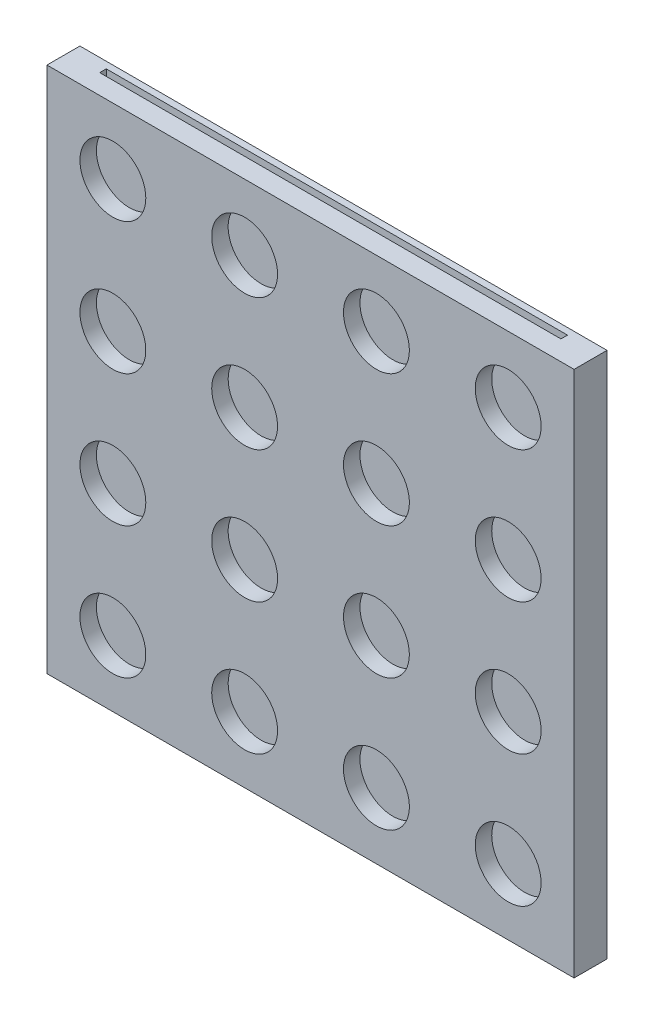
from build123d import *

# Parameters (mm, degrees)
SKETCH1_W           = 101.6
SKETCH1_H           = 101.6
BOSS_EXTRUDE1_DEPTH = 6.35
SKETCH3_R           = 6.35
CUT_EXTRUDE2_DEPTH  = 3.175
SKETCH4_W           = 88.9
SKETCH4_H           = 88.9
CUT_EXTRUDE3_DEPTH  = 2.54
CUT_EXTRUDE4_REACH  = 145.824
SKETCH5_W           = 88.9
SKETCH5_H           = 1.27


with BuildPart() as part:
    # Sketch1 → Boss-Extrude1 (new body)
    with BuildSketch(Plane.XY):
        with Locations((50.8, 50.8)):
            Rectangle(SKETCH1_W, SKETCH1_H)
    extrude(amount=BOSS_EXTRUDE1_DEPTH)

    # Sketch3 → Cut-Extrude2 (cut)
    with BuildSketch(Plane.XY.offset(6.35)):
        with Locations((12.7, 139.7)):
            Circle(SKETCH3_R)
        with Locations((38.1, 139.7)):
            Circle(SKETCH3_R)
        with Locations((63.5, 139.7)):
            Circle(SKETCH3_R)
        with Locations((88.9, 139.7)):
            Circle(SKETCH3_R)
        with Locations((88.9, 114.3)):
            Circle(SKETCH3_R)
        with Locations((63.5, 114.3)):
            Circle(SKETCH3_R)
        with Locations((38.1, 114.3)):
            Circle(SKETCH3_R)
        with Locations((12.7, 114.3)):
            Circle(SKETCH3_R)
        with Locations((88.9, 88.9)):
            Circle(SKETCH3_R)
        with Locations((63.5, 88.9)):
            Circle(SKETCH3_R)
        with Locations((38.1, 88.9)):
            Circle(SKETCH3_R)
        with Locations((12.7, 88.9)):
            Circle(SKETCH3_R)
        with Locations(Location((88.9, 63.5, 0), (0, 0, 180))):
            Circle(SKETCH3_R)
        with Locations(Location((63.5, 63.5, 0), (0, 0, 180))):
            Circle(SKETCH3_R)
        with Locations(Location((38.1, 63.5, 0), (0, 0, 180))):
            Circle(SKETCH3_R)
        with Locations(Location((12.7, 63.5, 0), (0, 0, 180))):
            Circle(SKETCH3_R)
        with Locations((88.9, 38.1)):
            Circle(SKETCH3_R)
        with Locations((63.5, 38.1)):
            Circle(SKETCH3_R)
        with Locations((38.1, 38.1)):
            Circle(SKETCH3_R)
        with Locations((12.7, 38.1)):
            Circle(SKETCH3_R)
        with Locations(Location((88.9, 12.7, 0), (0, 0, 180))):
            Circle(SKETCH3_R)
        with Locations(Location((63.5, 12.7, 0), (0, 0, 180))):
            Circle(SKETCH3_R)
        with Locations(Location((38.1, 12.7, 0), (0, 0, 180))):
            Circle(SKETCH3_R)
        with Locations(Location((12.7, 12.7, 0), (0, 0, 180))):
            Circle(SKETCH3_R)
    extrude(amount=-CUT_EXTRUDE2_DEPTH, mode=Mode.SUBTRACT)

    # Sketch4 → Cut-Extrude3 (cut)
    with BuildSketch(Plane(origin=(0, 0, 0), x_dir=(-1, 0, 0), z_dir=(0, 0, -1))):
        with Locations((-50.8, 50.8)):
            Rectangle(SKETCH4_W, SKETCH4_H)
    extrude(amount=-CUT_EXTRUDE3_DEPTH, mode=Mode.SUBTRACT)

    # Sketch5 → Cut-Extrude4 (cut, up to next)
    with BuildSketch(Plane(origin=(0, 101.6, 0), x_dir=(1, 0, 0), z_dir=(0, 1, 0)), mode=Mode.PRIVATE) as cut_extrude4_sk1:
        with Locations((50.8, -1.905)):
            Rectangle(SKETCH5_W, SKETCH5_H)
    cut_extrude4_tool1 = extrude(cut_extrude4_sk1.sketch, amount=-CUT_EXTRUDE4_REACH, mode=Mode.PRIVATE) & part.part
    add(cut_extrude4_tool1.solids().sort_by_distance((50.8, 101.6, 1.905))[0], mode=Mode.SUBTRACT)


solid = part.part
